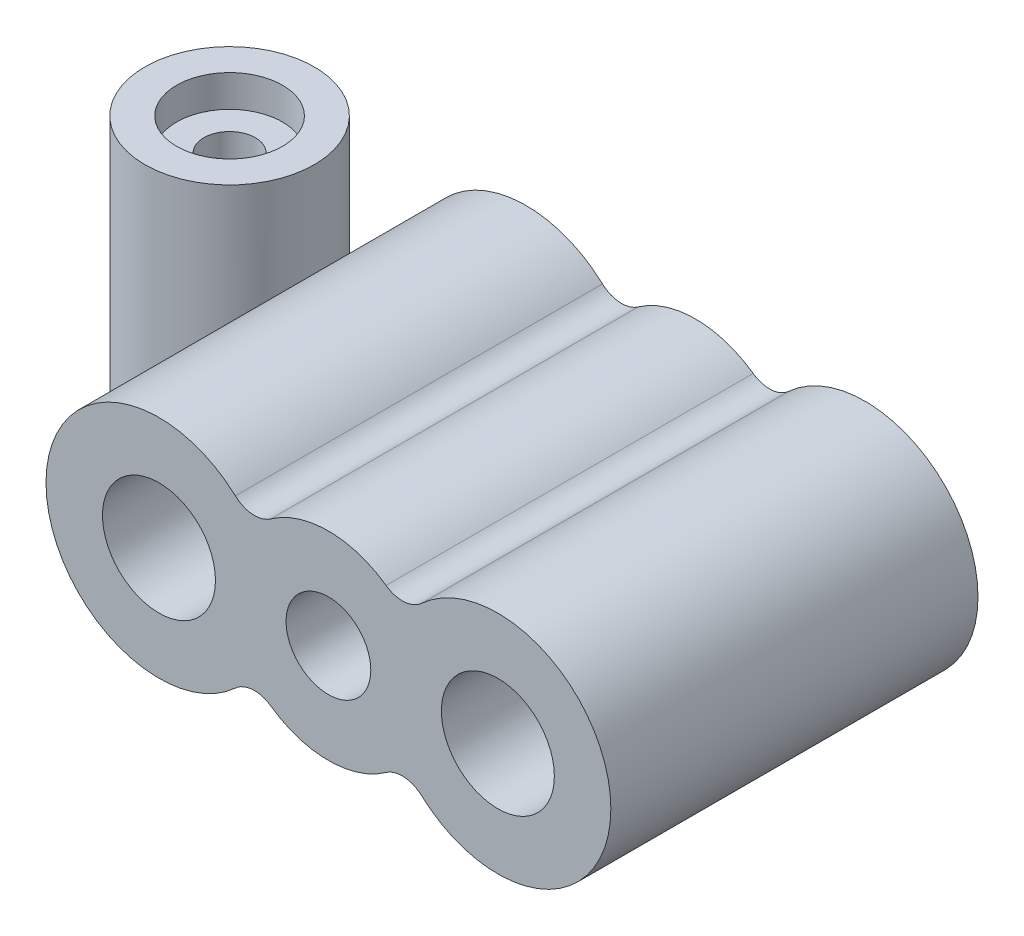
ISO-10303-21;
HEADER;
FILE_DESCRIPTION(('STEP AP214'),'2;1');
FILE_NAME('part.step','',(''),(''),'','','');
FILE_SCHEMA(('AUTOMOTIVE_DESIGN { 1 0 10303 214 1 1 1 1 }'));
ENDSEC;
DATA;
#1=APPLICATION_CONTEXT('core data for automotive mechanical design processes');
#2=APPLICATION_PROTOCOL_DEFINITION('international standard','automotive_design',2000,#1);
#3=PRODUCT_CONTEXT('',#1,'mechanical');
#4=PRODUCT('Part','Part','',(#3));
#5=PRODUCT_RELATED_PRODUCT_CATEGORY('part','',(#4));
#6=PRODUCT_DEFINITION_FORMATION('','',#4);
#7=PRODUCT_DEFINITION_CONTEXT('part definition',#1,'design');
#8=PRODUCT_DEFINITION('design','',#6,#7);
#9=PRODUCT_DEFINITION_SHAPE('','',#8);
#10=(LENGTH_UNIT() NAMED_UNIT(*) SI_UNIT(.MILLI.,.METRE.));
#11=(NAMED_UNIT(*) PLANE_ANGLE_UNIT() SI_UNIT($,.RADIAN.));
#12=(NAMED_UNIT(*) SI_UNIT($,.STERADIAN.) SOLID_ANGLE_UNIT());
#13=UNCERTAINTY_MEASURE_WITH_UNIT(LENGTH_MEASURE(1.E-05),#10,'distance_accuracy_value','');
#14=(GEOMETRIC_REPRESENTATION_CONTEXT(3) GLOBAL_UNCERTAINTY_ASSIGNED_CONTEXT((#13)) GLOBAL_UNIT_ASSIGNED_CONTEXT((#10,
#11,#12)) REPRESENTATION_CONTEXT('',''));
#15=CARTESIAN_POINT('',(0.,0.,0.));
#16=DIRECTION('',(0.,0.,1.));
#17=DIRECTION('',(1.,0.,0.));
#18=AXIS2_PLACEMENT_3D('',#15,#16,#17);
#19=CARTESIAN_POINT('',(-19.05,0.,20.6375));
#20=DIRECTION('',(0.,0.,-1.));
#21=DIRECTION('',(-1.,0.,0.));
#22=AXIS2_PLACEMENT_3D('',#19,#20,#21);
#23=CYLINDRICAL_SURFACE('',#22,12.7);
#24=CARTESIAN_POINT('',(-19.05,0.,-20.6375));
#25=DIRECTION('',(0.,0.,1.));
#26=DIRECTION('',(1.,0.,0.));
#27=AXIS2_PLACEMENT_3D('',#24,#25,#26);
#28=CIRCLE('',#27,12.7);
#29=CARTESIAN_POINT('',(-10.462768,9.356786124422,-20.6375));
#30=VERTEX_POINT('',#29);
#31=CARTESIAN_POINT('',(-10.462768,-9.356786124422,-20.6375));
#32=VERTEX_POINT('',#31);
#33=EDGE_CURVE('E96',#30,#32,#28,.T.);
#34=ORIENTED_EDGE('',*,*,#33,.T.);
#35=DIRECTION('',(0.,0.,-1.));
#36=VECTOR('',#35,1.);
#37=CARTESIAN_POINT('',(-10.462768,-9.356786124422,20.6375));
#38=LINE('',#37,#36);
#39=CARTESIAN_POINT('',(-10.462768,-9.356786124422,20.6375));
#40=VERTEX_POINT('',#39);
#41=EDGE_CURVE('E113',#40,#32,#38,.T.);
#42=ORIENTED_EDGE('',*,*,#41,.F.);
#43=CARTESIAN_POINT('',(-19.05,0.,20.6375));
#44=DIRECTION('',(0.,0.,1.));
#45=DIRECTION('',(1.,0.,0.));
#46=AXIS2_PLACEMENT_3D('',#43,#44,#45);
#47=CIRCLE('',#46,12.7);
#48=CARTESIAN_POINT('',(-10.462768,9.356786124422,20.6375));
#49=VERTEX_POINT('',#48);
#50=EDGE_CURVE('E110',#49,#40,#47,.T.);
#51=ORIENTED_EDGE('',*,*,#50,.F.);
#52=DIRECTION('',(0.,0.,-1.));
#53=VECTOR('',#52,1.);
#54=CARTESIAN_POINT('',(-10.462768,9.356786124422,20.6375));
#55=LINE('',#54,#53);
#56=EDGE_CURVE('E39',#49,#30,#55,.T.);
#57=ORIENTED_EDGE('',*,*,#56,.T.);
#58=EDGE_LOOP('',(#34,#42,#51,#57));
#59=FACE_BOUND('',#58,.T.);
#60=CARTESIAN_POINT('',(-31.75,0.,0.749515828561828));
#61=CARTESIAN_POINT('',(-31.7499985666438,0.250708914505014,0.749516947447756));
#62=CARTESIAN_POINT('',(-31.742564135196,0.501493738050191,0.742886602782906));
#63=CARTESIAN_POINT('',(-31.7129240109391,1.00157675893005,0.716206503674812));
#64=CARTESIAN_POINT('',(-31.6907100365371,1.25087404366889,0.696149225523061));
#65=CARTESIAN_POINT('',(-31.6317674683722,1.74689660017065,0.642081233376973));
#66=CARTESIAN_POINT('',(-31.5950017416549,1.99361362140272,0.608034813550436));
#67=CARTESIAN_POINT('',(-31.5075684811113,2.48204077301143,0.525252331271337));
#68=CARTESIAN_POINT('',(-31.4569031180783,2.72375167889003,0.476518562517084));
#69=CARTESIAN_POINT('',(-31.3423449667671,3.20137659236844,0.363139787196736));
#70=CARTESIAN_POINT('',(-31.2783968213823,3.43726156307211,0.298427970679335));
#71=CARTESIAN_POINT('',(-31.1387191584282,3.90016785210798,0.152032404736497));
#72=CARTESIAN_POINT('',(-31.0629884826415,4.12718829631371,0.0703469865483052));
#73=CARTESIAN_POINT('',(-30.9016998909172,4.56974501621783,-0.111026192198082));
#74=CARTESIAN_POINT('',(-30.8161612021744,4.78530258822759,-0.210678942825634));
#75=CARTESIAN_POINT('',(-30.6374644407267,5.20309915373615,-0.42918244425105));
#76=CARTESIAN_POINT('',(-30.5443087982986,5.40534235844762,-0.548027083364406));
#77=CARTESIAN_POINT('',(-30.3752977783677,5.74938841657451,-0.775969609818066));
#78=CARTESIAN_POINT('',(-30.3004057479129,5.89437539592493,-0.880996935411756));
#79=CARTESIAN_POINT('',(-30.1493398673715,6.17413200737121,-1.10303428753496));
#80=CARTESIAN_POINT('',(-30.0731662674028,6.30890360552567,-1.22004199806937));
#81=CARTESIAN_POINT('',(-29.9212108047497,6.56728576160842,-1.46595353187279));
#82=CARTESIAN_POINT('',(-29.8454288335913,6.69089958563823,-1.59485385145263));
#83=CARTESIAN_POINT('',(-29.6959837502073,6.92621561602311,-1.8642606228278));
#84=CARTESIAN_POINT('',(-29.622320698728,7.03791748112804,-2.00476740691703));
#85=CARTESIAN_POINT('',(-29.4786170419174,7.24916109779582,-2.2973417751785));
#86=CARTESIAN_POINT('',(-29.4085914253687,7.34865453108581,-2.4494516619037));
#87=CARTESIAN_POINT('',(-29.2742105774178,7.53449909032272,-2.76387522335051));
#88=CARTESIAN_POINT('',(-29.2098554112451,7.62085006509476,-2.92618901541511));
#89=CARTESIAN_POINT('',(-29.0884261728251,7.78010513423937,-3.25990449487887));
#90=CARTESIAN_POINT('',(-29.031352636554,7.85300823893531,-3.43130684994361));
#91=CARTESIAN_POINT('',(-28.9259176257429,7.98519929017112,-3.78186239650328));
#92=CARTESIAN_POINT('',(-28.8775556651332,8.04448799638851,-3.96101515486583));
#93=CARTESIAN_POINT('',(-28.7938092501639,8.14568491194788,-4.31265938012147));
#94=CARTESIAN_POINT('',(-28.7577475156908,8.18852777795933,-4.48472170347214));
#95=CARTESIAN_POINT('',(-28.6949115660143,8.26244746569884,-4.83301448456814));
#96=CARTESIAN_POINT('',(-28.6681368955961,8.29352486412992,-5.0092447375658));
#97=CARTESIAN_POINT('',(-28.6244223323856,8.34395301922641,-5.36456020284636));
#98=CARTESIAN_POINT('',(-28.6074814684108,8.36330493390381,-5.54364513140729));
#99=CARTESIAN_POINT('',(-28.5837701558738,8.39032486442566,-5.90336437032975));
#100=CARTESIAN_POINT('',(-28.5769997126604,8.39799287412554,-6.08399868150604));
#101=CARTESIAN_POINT('',(-28.5737944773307,8.4016273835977,-6.44201899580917));
#102=CARTESIAN_POINT('',(-28.5771645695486,8.39781478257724,-6.61940108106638));
#103=CARTESIAN_POINT('',(-28.5937540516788,8.37895674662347,-6.97310207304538));
#104=CARTESIAN_POINT('',(-28.6069732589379,8.36391152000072,-7.14942099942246));
#105=CARTESIAN_POINT('',(-28.6430045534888,8.32256053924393,-7.49972216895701));
#106=CARTESIAN_POINT('',(-28.6658155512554,8.29625606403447,-7.6737046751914));
#107=CARTESIAN_POINT('',(-28.7205857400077,8.23234718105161,-8.01811811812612));
#108=CARTESIAN_POINT('',(-28.7525449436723,8.1947427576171,-8.18854904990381));
#109=CARTESIAN_POINT('',(-28.8249568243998,8.10823012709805,-8.52456191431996));
#110=CARTESIAN_POINT('',(-28.8654046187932,8.05932841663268,-8.6901465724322));
#111=CARTESIAN_POINT('',(-28.9539876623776,7.95021773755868,-9.01542631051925));
#112=CARTESIAN_POINT('',(-29.0021228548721,7.89000885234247,-9.17512143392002));
#113=CARTESIAN_POINT('',(-29.105085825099,7.75836489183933,-9.48754594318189));
#114=CARTESIAN_POINT('',(-29.1599127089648,7.68693131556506,-9.6402762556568));
#115=CARTESIAN_POINT('',(-29.2751268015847,7.53299536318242,-9.93785421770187));
#116=CARTESIAN_POINT('',(-29.3355140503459,7.45049290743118,-10.0827018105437));
#117=CARTESIAN_POINT('',(-29.461299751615,7.2737014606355,-10.3653052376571));
#118=CARTESIAN_POINT('',(-29.5267470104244,7.17929011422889,-10.5029627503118));
#119=CARTESIAN_POINT('',(-29.6606974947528,6.97979475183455,-10.7688197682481));
#120=CARTESIAN_POINT('',(-29.7292019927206,6.87470626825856,-10.8970152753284));
#121=CARTESIAN_POINT('',(-29.8678431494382,6.65441233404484,-11.1434552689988));
#122=CARTESIAN_POINT('',(-29.9379799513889,6.53920599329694,-11.2616988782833));
#123=CARTESIAN_POINT('',(-30.0784754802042,6.29936796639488,-11.4879471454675));
#124=CARTESIAN_POINT('',(-30.1488341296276,6.17473928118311,-11.5959550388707));
#125=CARTESIAN_POINT('',(-30.2926894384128,5.90898537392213,-11.8079216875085));
#126=CARTESIAN_POINT('',(-30.3661202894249,5.76731879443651,-11.9112461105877));
#127=CARTESIAN_POINT('',(-30.5103552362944,5.47510810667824,-12.1065318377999));
#128=CARTESIAN_POINT('',(-30.5811592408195,5.32456369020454,-12.1984927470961));
#129=CARTESIAN_POINT('',(-30.7188983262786,5.01551991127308,-12.3713941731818));
#130=CARTESIAN_POINT('',(-30.7858320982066,4.85701789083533,-12.4523309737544));
#131=CARTESIAN_POINT('',(-30.9147243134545,4.53306927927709,-12.6035840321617));
#132=CARTESIAN_POINT('',(-30.9766821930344,4.36762190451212,-12.6738990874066));
#133=CARTESIAN_POINT('',(-31.1023994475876,4.00878431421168,-12.8129026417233));
#134=CARTESIAN_POINT('',(-31.1653414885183,3.81456227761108,-12.8801851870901));
#135=CARTESIAN_POINT('',(-31.282638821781,3.41979013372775,-13.0025480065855));
#136=CARTESIAN_POINT('',(-31.3369934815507,3.21923956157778,-13.0576273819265));
#137=CARTESIAN_POINT('',(-31.436321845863,2.81296656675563,-13.1563150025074));
#138=CARTESIAN_POINT('',(-31.4812913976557,2.60724189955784,-13.1999181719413));
#139=CARTESIAN_POINT('',(-31.5612137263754,2.1918661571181,-13.2762506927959));
#140=CARTESIAN_POINT('',(-31.5961657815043,1.98221480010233,-13.3089792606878));
#141=CARTESIAN_POINT('',(-31.6599899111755,1.52902556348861,-13.3681246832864));
#142=CARTESIAN_POINT('',(-31.6872115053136,1.28503917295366,-13.3929050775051));
#143=CARTESIAN_POINT('',(-31.7274832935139,0.794919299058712,-13.429363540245));
#144=CARTESIAN_POINT('',(-31.7405322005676,0.54878562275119,-13.4410404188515));
#145=CARTESIAN_POINT('',(-31.7522733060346,0.0557212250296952,-13.4515530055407));
#146=CARTESIAN_POINT('',(-31.7509550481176,-0.191209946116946,-13.4503793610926));
#147=CARTESIAN_POINT('',(-31.7339556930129,-0.684179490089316,-13.43514160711));
#148=CARTESIAN_POINT('',(-31.7182743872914,-0.930217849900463,-13.4210773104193));
#149=CARTESIAN_POINT('',(-31.6710867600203,-1.43801808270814,-13.3782148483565));
#150=CARTESIAN_POINT('',(-31.6384946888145,-1.69959531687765,-13.3484028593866));
#151=CARTESIAN_POINT('',(-31.5575686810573,-2.21800641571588,-13.2728087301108));
#152=CARTESIAN_POINT('',(-31.5092329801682,-2.47483974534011,-13.2270247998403));
#153=CARTESIAN_POINT('',(-31.3978076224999,-2.9814169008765,-13.1184774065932));
#154=CARTESIAN_POINT('',(-31.3347299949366,-3.23116632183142,-13.0557277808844));
#155=CARTESIAN_POINT('',(-31.1951849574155,-3.7214774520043,-12.9119500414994));
#156=CARTESIAN_POINT('',(-31.118720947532,-3.96204147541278,-12.8309265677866));
#157=CARTESIAN_POINT('',(-30.970891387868,-4.38427400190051,-12.6675140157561));
#158=CARTESIAN_POINT('',(-30.9015967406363,-4.56805192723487,-12.5886814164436));
#159=CARTESIAN_POINT('',(-30.7569782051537,-4.92687021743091,-12.4177988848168));
#160=CARTESIAN_POINT('',(-30.6816554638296,-5.10191223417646,-12.3257514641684));
#161=CARTESIAN_POINT('',(-30.5265519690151,-5.44184180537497,-12.1279141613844));
#162=CARTESIAN_POINT('',(-30.4467736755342,-5.60673485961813,-12.0221318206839));
#163=CARTESIAN_POINT('',(-30.2845273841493,-5.92514323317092,-11.7964046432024));
#164=CARTESIAN_POINT('',(-30.2020593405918,-6.07865835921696,-11.6764595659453));
#165=CARTESIAN_POINT('',(-30.0359419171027,-6.37400808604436,-11.4214775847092));
#166=CARTESIAN_POINT('',(-29.9522883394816,-6.51575985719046,-11.2863472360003));
#167=CARTESIAN_POINT('',(-29.786599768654,-6.78531233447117,-11.0018901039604));
#168=CARTESIAN_POINT('',(-29.7045648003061,-6.91311282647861,-10.852563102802));
#169=CARTESIAN_POINT('',(-29.5444867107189,-7.15378520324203,-10.5404136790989));
#170=CARTESIAN_POINT('',(-29.4664424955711,-7.26666119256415,-10.377594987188));
#171=CARTESIAN_POINT('',(-29.3166363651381,-7.47682037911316,-10.0394872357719));
#172=CARTESIAN_POINT('',(-29.24487370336,-7.57410543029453,-9.86419966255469));
#173=CARTESIAN_POINT('',(-29.1175489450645,-7.74236911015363,-9.52338758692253));
#174=CARTESIAN_POINT('',(-29.0610728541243,-7.81508650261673,-9.35905944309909));
#175=CARTESIAN_POINT('',(-28.9560327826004,-7.94780990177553,-9.02291667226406));
#176=CARTESIAN_POINT('',(-28.9074681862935,-8.00781689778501,-8.8511026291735));
#177=CARTESIAN_POINT('',(-28.8193738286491,-8.11505730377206,-8.50130900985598));
#178=CARTESIAN_POINT('',(-28.7798429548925,-8.16229228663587,-8.32333019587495));
#179=CARTESIAN_POINT('',(-28.7107012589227,-8.24401123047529,-7.96258170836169));
#180=CARTESIAN_POINT('',(-28.6810902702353,-8.27849540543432,-7.77981211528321));
#181=CARTESIAN_POINT('',(-28.633717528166,-8.3332825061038,-7.42060976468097));
#182=CARTESIAN_POINT('',(-28.615416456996,-8.35423350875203,-7.24434639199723));
#183=CARTESIAN_POINT('',(-28.5886662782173,-8.38476355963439,-6.89009679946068));
#184=CARTESIAN_POINT('',(-28.580216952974,-8.39434285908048,-6.71211061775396));
#185=CARTESIAN_POINT('',(-28.5733344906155,-8.40215015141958,-6.3557173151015));
#186=CARTESIAN_POINT('',(-28.5749002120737,-8.40037943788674,-6.17731024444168));
#187=CARTESIAN_POINT('',(-28.5880148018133,-8.38548578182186,-5.82133732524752));
#188=CARTESIAN_POINT('',(-28.5995637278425,-8.37236277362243,-5.64377148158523));
#189=CARTESIAN_POINT('',(-28.6323165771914,-8.33485590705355,-5.29187694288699));
#190=CARTESIAN_POINT('',(-28.6534590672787,-8.31054368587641,-5.11753488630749));
#191=CARTESIAN_POINT('',(-28.7049692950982,-8.25064398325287,-4.77218430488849));
#192=CARTESIAN_POINT('',(-28.7353369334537,-8.21505662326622,-4.60117574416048));
#193=CARTESIAN_POINT('',(-28.8046932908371,-8.13258005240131,-4.26371956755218));
#194=CARTESIAN_POINT('',(-28.8436808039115,-8.08569242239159,-4.09727131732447));
#195=CARTESIAN_POINT('',(-28.9294952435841,-7.98061219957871,-3.77006285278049));
#196=CARTESIAN_POINT('',(-28.9763221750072,-7.92241959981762,-3.60930264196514));
#197=CARTESIAN_POINT('',(-29.0769784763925,-7.79463461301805,-3.29416365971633));
#198=CARTESIAN_POINT('',(-29.1308244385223,-7.72501510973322,-3.13980118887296));
#199=CARTESIAN_POINT('',(-29.2443098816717,-7.57462306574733,-2.83884005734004));
#200=CARTESIAN_POINT('',(-29.3039493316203,-7.49385058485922,-2.69224135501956));
#201=CARTESIAN_POINT('',(-29.4277647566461,-7.32142443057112,-2.40766079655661));
#202=CARTESIAN_POINT('',(-29.4919398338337,-7.22977290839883,-2.26967724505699));
#203=CARTESIAN_POINT('',(-29.6235321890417,-7.03591794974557,-2.00290299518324));
#204=CARTESIAN_POINT('',(-29.6909506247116,-6.93371073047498,-1.87411562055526));
#205=CARTESIAN_POINT('',(-29.8295519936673,-6.71627387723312,-1.62279343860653));
#206=CARTESIAN_POINT('',(-29.900787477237,-6.60076051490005,-1.50053325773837));
#207=CARTESIAN_POINT('',(-30.0437582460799,-6.35978816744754,-1.26655648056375));
#208=CARTESIAN_POINT('',(-30.1154935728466,-6.23432834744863,-1.15484077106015));
#209=CARTESIAN_POINT('',(-30.258074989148,-5.97419914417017,-0.942019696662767));
#210=CARTESIAN_POINT('',(-30.3289208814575,-5.83952775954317,-0.840916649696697));
#211=CARTESIAN_POINT('',(-30.4684022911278,-5.56185464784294,-0.649264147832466));
#212=CARTESIAN_POINT('',(-30.5370382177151,-5.4188544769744,-0.558712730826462));
#213=CARTESIAN_POINT('',(-30.6771997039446,-5.11168344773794,-0.379929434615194));
#214=CARTESIAN_POINT('',(-30.7483992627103,-4.94678113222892,-0.292698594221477));
#215=CARTESIAN_POINT('',(-30.885496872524,-4.60914544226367,-0.130041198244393));
#216=CARTESIAN_POINT('',(-30.9513945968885,-4.43641158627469,-0.0546153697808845));
#217=CARTESIAN_POINT('',(-31.0768642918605,-4.0840594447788,0.0850613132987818));
#218=CARTESIAN_POINT('',(-31.1364302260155,-3.90443480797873,0.149301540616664));
#219=CARTESIAN_POINT('',(-31.2482904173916,-3.53951194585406,0.267121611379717));
#220=CARTESIAN_POINT('',(-31.3005839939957,-3.35421319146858,0.320700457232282));
#221=CARTESIAN_POINT('',(-31.4044537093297,-2.95078174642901,0.425064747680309));
#222=CARTESIAN_POINT('',(-31.4547439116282,-2.73189556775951,0.474223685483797));
#223=CARTESIAN_POINT('',(-31.5439882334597,-2.28937295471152,0.56000461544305));
#224=CARTESIAN_POINT('',(-31.5829398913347,-2.06573550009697,0.59662388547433));
#225=CARTESIAN_POINT('',(-31.6488858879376,-1.61547803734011,0.657907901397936));
#226=CARTESIAN_POINT('',(-31.6758995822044,-1.38886347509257,0.682592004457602));
#227=CARTESIAN_POINT('',(-31.717695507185,-0.933645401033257,0.720545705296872));
#228=CARTESIAN_POINT('',(-31.7324835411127,-0.705042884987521,0.733820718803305));
#229=CARTESIAN_POINT('',(-31.7440482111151,-0.396791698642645,0.744188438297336));
#230=CARTESIAN_POINT('',(-31.7462795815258,-0.317463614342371,0.746186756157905));
#231=CARTESIAN_POINT('',(-31.7492556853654,-0.158759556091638,0.748850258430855));
#232=CARTESIAN_POINT('',(-31.7500004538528,-0.0793835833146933,0.749515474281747));
#233=CARTESIAN_POINT('',(-31.75,0.,0.749515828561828));
#234=B_SPLINE_CURVE_WITH_KNOTS('',3,(#60,#61,#62,#63,#64,#65,#66,#67,#68,#69,#70,#71,#72,#73,
#74,#75,#76,#77,#78,#79,#80,#81,#82,#83,#84,#85,#86,#87,#88,#89,#90,#91,#92,#93,#94,#95,#96,#97,
#98,#99,#100,#101,#102,#103,#104,#105,#106,#107,#108,#109,#110,#111,#112,#113,#114,#115,#116,
#117,#118,#119,#120,#121,#122,#123,#124,#125,#126,#127,#128,#129,#130,#131,#132,#133,#134,#135,
#136,#137,#138,#139,#140,#141,#142,#143,#144,#145,#146,#147,#148,#149,#150,#151,#152,#153,#154,
#155,#156,#157,#158,#159,#160,#161,#162,#163,#164,#165,#166,#167,#168,#169,#170,#171,#172,#173,
#174,#175,#176,#177,#178,#179,#180,#181,#182,#183,#184,#185,#186,#187,#188,#189,#190,#191,#192,
#193,#194,#195,#196,#197,#198,#199,#200,#201,#202,#203,#204,#205,#206,#207,#208,#209,#210,#211,
#212,#213,#214,#215,#216,#217,#218,#219,#220,#221,#222,#223,#224,#225,#226,#227,#228,#229,#230,
#231,#232,#233),.UNSPECIFIED.,.T.,.F.,(4,2,2,2,2,2,2,2,2,2,2,2,2,2,2,2,2,2,2,2,2,2,2,2,2,2,2,2,
2,2,2,2,2,2,2,2,2,2,2,2,2,2,2,2,2,2,2,2,2,2,2,2,2,2,2,2,2,2,2,2,2,2,2,2,2,2,2,2,2,2,2,2,2,2,2,2,
2,2,2,2,2,2,2,2,2,2,4),(0.,0.752059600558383,1.50454096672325,2.25895501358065,3.01325130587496,
3.77075664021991,4.52833648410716,5.28445580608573,6.04033481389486,6.62193433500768,
7.20342163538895,7.78473816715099,8.36607134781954,8.94963579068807,9.53320694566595,
10.1168210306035,10.7004025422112,11.2425812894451,11.7847334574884,12.3268320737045,
12.8689309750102,13.4006663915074,13.9323919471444,14.4640571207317,14.9957230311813,
15.5270839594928,16.058440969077,16.5897270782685,17.1210170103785,17.6582945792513,
18.1957978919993,18.7333485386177,19.2707286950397,19.8404323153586,20.4101557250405,
20.9800707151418,21.5500501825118,22.1943036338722,22.8386045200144,23.4831898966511,
24.1278217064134,24.8672713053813,25.6067880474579,26.3468430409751,27.0869087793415,
27.8817705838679,28.6767214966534,29.4710259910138,30.2651290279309,30.8994171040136,
31.5335847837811,32.1674057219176,32.8012374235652,33.4392084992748,34.0771893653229,
34.714994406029,35.3527235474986,35.9170943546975,36.4814212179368,37.0456785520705,
37.6099264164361,38.1446255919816,38.6793129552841,39.2139393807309,39.748568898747,
40.2798221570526,40.8110696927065,41.3422429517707,41.8734165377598,42.4058693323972,
42.9383192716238,43.4706640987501,44.0032003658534,44.5505916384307,45.0980289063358,
45.6455854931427,46.1930400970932,46.7914691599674,47.3899350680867,47.9889665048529,
48.5880539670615,49.2770671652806,49.9662298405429,50.6542710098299,51.3419853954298,
51.5801205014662,51.8182499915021),.UNSPECIFIED.);
#235=CARTESIAN_POINT('',(-31.75,0.,0.749515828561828));
#236=VERTEX_POINT('',#235);
#237=EDGE_CURVE('E11',#236,#236,#234,.T.);
#238=ORIENTED_EDGE('',*,*,#237,.F.);
#239=EDGE_LOOP('',(#238));
#240=FACE_BOUND('',#239,.T.);
#241=ADVANCED_FACE('F28',(#59,#240),#23,.T.);
#242=CARTESIAN_POINT('',(-8.31596,11.6959826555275,20.6375));
#243=DIRECTION('',(0.,0.,-1.));
#244=DIRECTION('',(-1.,0.,0.));
#245=AXIS2_PLACEMENT_3D('',#242,#243,#244);
#246=CYLINDRICAL_SURFACE('',#245,3.175);
#247=CARTESIAN_POINT('',(-8.31596,11.6959826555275,-20.6375));
#248=DIRECTION('',(0.,0.,-1.));
#249=DIRECTION('',(1.,0.,0.));
#250=AXIS2_PLACEMENT_3D('',#247,#248,#249);
#251=CIRCLE('',#250,3.175);
#252=CARTESIAN_POINT('',(-6.47614584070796,9.10837587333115,-20.6375));
#253=VERTEX_POINT('',#252);
#254=EDGE_CURVE('E101',#253,#30,#251,.T.);
#255=ORIENTED_EDGE('',*,*,#254,.T.);
#256=ORIENTED_EDGE('',*,*,#56,.F.);
#257=CARTESIAN_POINT('',(-8.31596,11.6959826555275,20.6375));
#258=DIRECTION('',(0.,0.,-1.));
#259=DIRECTION('',(1.,0.,0.));
#260=AXIS2_PLACEMENT_3D('',#257,#258,#259);
#261=CIRCLE('',#260,3.175);
#262=CARTESIAN_POINT('',(-6.47614584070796,9.10837587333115,20.6375));
#263=VERTEX_POINT('',#262);
#264=EDGE_CURVE('E134',#263,#49,#261,.T.);
#265=ORIENTED_EDGE('',*,*,#264,.F.);
#266=DIRECTION('',(0.,0.,-1.));
#267=VECTOR('',#266,1.);
#268=CARTESIAN_POINT('',(-6.47614584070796,9.10837587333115,20.6375));
#269=LINE('',#268,#267);
#270=EDGE_CURVE('E115',#263,#253,#269,.T.);
#271=ORIENTED_EDGE('',*,*,#270,.T.);
#272=EDGE_LOOP('',(#255,#256,#265,#271));
#273=FACE_BOUND('',#272,.T.);
#274=ADVANCED_FACE('F30',(#273),#246,.F.);
#275=CARTESIAN_POINT('',(-8.31596,-11.6959826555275,20.6375));
#276=DIRECTION('',(0.,0.,-1.));
#277=DIRECTION('',(-1.,0.,0.));
#278=AXIS2_PLACEMENT_3D('',#275,#276,#277);
#279=CYLINDRICAL_SURFACE('',#278,3.175);
#280=CARTESIAN_POINT('',(-8.31596,-11.6959826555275,-20.6375));
#281=DIRECTION('',(0.,0.,-1.));
#282=DIRECTION('',(-1.,0.,0.));
#283=AXIS2_PLACEMENT_3D('',#280,#281,#282);
#284=CIRCLE('',#283,3.175);
#285=CARTESIAN_POINT('',(-6.47614584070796,-9.10837587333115,-20.6375));
#286=VERTEX_POINT('',#285);
#287=EDGE_CURVE('E103',#32,#286,#284,.T.);
#288=ORIENTED_EDGE('',*,*,#287,.T.);
#289=DIRECTION('',(0.,0.,-1.));
#290=VECTOR('',#289,1.);
#291=CARTESIAN_POINT('',(-6.47614584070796,-9.10837587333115,20.6375));
#292=LINE('',#291,#290);
#293=CARTESIAN_POINT('',(-6.47614584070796,-9.10837587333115,20.6375));
#294=VERTEX_POINT('',#293);
#295=EDGE_CURVE('E160',#294,#286,#292,.T.);
#296=ORIENTED_EDGE('',*,*,#295,.F.);
#297=CARTESIAN_POINT('',(-8.31596,-11.6959826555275,20.6375));
#298=DIRECTION('',(0.,0.,-1.));
#299=DIRECTION('',(-1.,0.,0.));
#300=AXIS2_PLACEMENT_3D('',#297,#298,#299);
#301=CIRCLE('',#300,3.175);
#302=EDGE_CURVE('E137',#40,#294,#301,.T.);
#303=ORIENTED_EDGE('',*,*,#302,.F.);
#304=ORIENTED_EDGE('',*,*,#41,.T.);
#305=EDGE_LOOP('',(#288,#296,#303,#304));
#306=FACE_BOUND('',#305,.T.);
#307=ADVANCED_FACE('F165',(#306),#279,.F.);
#308=CARTESIAN_POINT('',(0.,0.,20.6375));
#309=DIRECTION('',(0.,0.,-1.));
#310=DIRECTION('',(-1.,0.,0.));
#311=AXIS2_PLACEMENT_3D('',#308,#309,#310);
#312=CYLINDRICAL_SURFACE('',#311,11.176);
#313=CARTESIAN_POINT('',(0.,0.,-20.6375));
#314=DIRECTION('',(0.,0.,1.));
#315=DIRECTION('',(1.,0.,0.));
#316=AXIS2_PLACEMENT_3D('',#313,#314,#315);
#317=CIRCLE('',#316,11.176);
#318=CARTESIAN_POINT('',(6.47614584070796,-9.10837587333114,-20.6375));
#319=VERTEX_POINT('',#318);
#320=EDGE_CURVE('E124',#286,#319,#317,.T.);
#321=ORIENTED_EDGE('',*,*,#320,.T.);
#322=DIRECTION('',(0.,0.,-1.));
#323=VECTOR('',#322,1.);
#324=CARTESIAN_POINT('',(6.47614584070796,-9.10837587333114,20.6375));
#325=LINE('',#324,#323);
#326=CARTESIAN_POINT('',(6.47614584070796,-9.10837587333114,20.6375));
#327=VERTEX_POINT('',#326);
#328=EDGE_CURVE('E157',#327,#319,#325,.T.);
#329=ORIENTED_EDGE('',*,*,#328,.F.);
#330=CARTESIAN_POINT('',(0.,0.,20.6375));
#331=DIRECTION('',(0.,0.,1.));
#332=DIRECTION('',(1.,0.,0.));
#333=AXIS2_PLACEMENT_3D('',#330,#331,#332);
#334=CIRCLE('',#333,11.176);
#335=EDGE_CURVE('E139',#294,#327,#334,.T.);
#336=ORIENTED_EDGE('',*,*,#335,.F.);
#337=ORIENTED_EDGE('',*,*,#295,.T.);
#338=EDGE_LOOP('',(#321,#329,#336,#337));
#339=FACE_BOUND('',#338,.T.);
#340=ADVANCED_FACE('F173',(#339),#312,.T.);
#341=CARTESIAN_POINT('',(8.31596,-11.6959826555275,20.6375));
#342=DIRECTION('',(0.,0.,-1.));
#343=DIRECTION('',(-1.,0.,0.));
#344=AXIS2_PLACEMENT_3D('',#341,#342,#343);
#345=CYLINDRICAL_SURFACE('',#344,3.175);
#346=CARTESIAN_POINT('',(8.31596,-11.6959826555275,-20.6375));
#347=DIRECTION('',(0.,0.,-1.));
#348=DIRECTION('',(1.,0.,0.));
#349=AXIS2_PLACEMENT_3D('',#346,#347,#348);
#350=CIRCLE('',#349,3.175);
#351=CARTESIAN_POINT('',(10.462768,-9.35678612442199,-20.6375));
#352=VERTEX_POINT('',#351);
#353=EDGE_CURVE('E126',#319,#352,#350,.T.);
#354=ORIENTED_EDGE('',*,*,#353,.T.);
#355=DIRECTION('',(0.,0.,-1.));
#356=VECTOR('',#355,1.);
#357=CARTESIAN_POINT('',(10.462768,-9.35678612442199,20.6375));
#358=LINE('',#357,#356);
#359=CARTESIAN_POINT('',(10.462768,-9.35678612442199,20.6375));
#360=VERTEX_POINT('',#359);
#361=EDGE_CURVE('E154',#360,#352,#358,.T.);
#362=ORIENTED_EDGE('',*,*,#361,.F.);
#363=CARTESIAN_POINT('',(8.31596,-11.6959826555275,20.6375));
#364=DIRECTION('',(0.,0.,-1.));
#365=DIRECTION('',(1.,0.,0.));
#366=AXIS2_PLACEMENT_3D('',#363,#364,#365);
#367=CIRCLE('',#366,3.175);
#368=EDGE_CURVE('E141',#327,#360,#367,.T.);
#369=ORIENTED_EDGE('',*,*,#368,.F.);
#370=ORIENTED_EDGE('',*,*,#328,.T.);
#371=EDGE_LOOP('',(#354,#362,#369,#370));
#372=FACE_BOUND('',#371,.T.);
#373=ADVANCED_FACE('F176',(#372),#345,.F.);
#374=CARTESIAN_POINT('',(19.05,0.,20.6375));
#375=DIRECTION('',(0.,0.,-1.));
#376=DIRECTION('',(-1.,0.,0.));
#377=AXIS2_PLACEMENT_3D('',#374,#375,#376);
#378=CYLINDRICAL_SURFACE('',#377,12.7);
#379=CARTESIAN_POINT('',(19.05,0.,-20.6375));
#380=DIRECTION('',(0.,0.,1.));
#381=DIRECTION('',(1.,0.,0.));
#382=AXIS2_PLACEMENT_3D('',#379,#380,#381);
#383=CIRCLE('',#382,12.7);
#384=CARTESIAN_POINT('',(10.462768,9.35678612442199,-20.6375));
#385=VERTEX_POINT('',#384);
#386=EDGE_CURVE('E128',#352,#385,#383,.T.);
#387=ORIENTED_EDGE('',*,*,#386,.T.);
#388=DIRECTION('',(0.,0.,-1.));
#389=VECTOR('',#388,1.);
#390=CARTESIAN_POINT('',(10.462768,9.35678612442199,20.6375));
#391=LINE('',#390,#389);
#392=CARTESIAN_POINT('',(10.462768,9.35678612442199,20.6375));
#393=VERTEX_POINT('',#392);
#394=EDGE_CURVE('E151',#393,#385,#391,.T.);
#395=ORIENTED_EDGE('',*,*,#394,.F.);
#396=CARTESIAN_POINT('',(19.05,0.,20.6375));
#397=DIRECTION('',(0.,0.,1.));
#398=DIRECTION('',(1.,0.,0.));
#399=AXIS2_PLACEMENT_3D('',#396,#397,#398);
#400=CIRCLE('',#399,12.7);
#401=EDGE_CURVE('E143',#360,#393,#400,.T.);
#402=ORIENTED_EDGE('',*,*,#401,.F.);
#403=ORIENTED_EDGE('',*,*,#361,.T.);
#404=EDGE_LOOP('',(#387,#395,#402,#403));
#405=FACE_BOUND('',#404,.T.);
#406=ADVANCED_FACE('F181',(#405),#378,.T.);
#407=CARTESIAN_POINT('',(8.31596,11.6959826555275,20.6375));
#408=DIRECTION('',(0.,0.,-1.));
#409=DIRECTION('',(-1.,0.,0.));
#410=AXIS2_PLACEMENT_3D('',#407,#408,#409);
#411=CYLINDRICAL_SURFACE('',#410,3.175);
#412=CARTESIAN_POINT('',(8.31596,11.6959826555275,-20.6375));
#413=DIRECTION('',(0.,0.,-1.));
#414=DIRECTION('',(-1.,0.,0.));
#415=AXIS2_PLACEMENT_3D('',#412,#413,#414);
#416=CIRCLE('',#415,3.175);
#417=CARTESIAN_POINT('',(6.47614584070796,9.10837587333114,-20.6375));
#418=VERTEX_POINT('',#417);
#419=EDGE_CURVE('E130',#385,#418,#416,.T.);
#420=ORIENTED_EDGE('',*,*,#419,.T.);
#421=DIRECTION('',(0.,0.,-1.));
#422=VECTOR('',#421,1.);
#423=CARTESIAN_POINT('',(6.47614584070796,9.10837587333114,20.6375));
#424=LINE('',#423,#422);
#425=CARTESIAN_POINT('',(6.47614584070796,9.10837587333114,20.6375));
#426=VERTEX_POINT('',#425);
#427=EDGE_CURVE('E148',#426,#418,#424,.T.);
#428=ORIENTED_EDGE('',*,*,#427,.F.);
#429=CARTESIAN_POINT('',(8.31596,11.6959826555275,20.6375));
#430=DIRECTION('',(0.,0.,-1.));
#431=DIRECTION('',(-1.,0.,0.));
#432=AXIS2_PLACEMENT_3D('',#429,#430,#431);
#433=CIRCLE('',#432,3.175);
#434=EDGE_CURVE('E51',#393,#426,#433,.T.);
#435=ORIENTED_EDGE('',*,*,#434,.F.);
#436=ORIENTED_EDGE('',*,*,#394,.T.);
#437=EDGE_LOOP('',(#420,#428,#435,#436));
#438=FACE_BOUND('',#437,.T.);
#439=ADVANCED_FACE('F184',(#438),#411,.F.);
#440=CARTESIAN_POINT('',(0.,0.,20.6375));
#441=DIRECTION('',(0.,0.,-1.));
#442=DIRECTION('',(-1.,0.,0.));
#443=AXIS2_PLACEMENT_3D('',#440,#441,#442);
#444=CYLINDRICAL_SURFACE('',#443,11.176);
#445=CARTESIAN_POINT('',(0.,0.,-20.6375));
#446=DIRECTION('',(0.,0.,1.));
#447=DIRECTION('',(1.,0.,0.));
#448=AXIS2_PLACEMENT_3D('',#445,#446,#447);
#449=CIRCLE('',#448,11.176);
#450=EDGE_CURVE('E132',#418,#253,#449,.T.);
#451=ORIENTED_EDGE('',*,*,#450,.T.);
#452=ORIENTED_EDGE('',*,*,#270,.F.);
#453=CARTESIAN_POINT('',(0.,0.,20.6375));
#454=DIRECTION('',(0.,0.,1.));
#455=DIRECTION('',(1.,0.,0.));
#456=AXIS2_PLACEMENT_3D('',#453,#454,#455);
#457=CIRCLE('',#456,11.176);
#458=EDGE_CURVE('E46',#426,#263,#457,.T.);
#459=ORIENTED_EDGE('',*,*,#458,.F.);
#460=ORIENTED_EDGE('',*,*,#427,.T.);
#461=EDGE_LOOP('',(#451,#452,#459,#460));
#462=FACE_BOUND('',#461,.T.);
#463=ADVANCED_FACE('F186',(#462),#444,.T.);
#464=CARTESIAN_POINT('',(-4.15798,5.84799132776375,20.6375));
#465=DIRECTION('',(0.,0.,1.));
#466=DIRECTION('',(1.,0.,0.));
#467=AXIS2_PLACEMENT_3D('',#464,#465,#466);
#468=PLANE('',#467);
#469=CARTESIAN_POINT('',(19.05,0.,20.637499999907));
#470=DIRECTION('',(0.,0.,1.));
#471=DIRECTION('',(1.,0.,0.));
#472=AXIS2_PLACEMENT_3D('',#469,#470,#471);
#473=CIRCLE('',#472,6.35);
#474=CARTESIAN_POINT('',(25.4,0.,20.637499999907));
#475=VERTEX_POINT('',#474);
#476=EDGE_CURVE('E322',#475,#475,#473,.T.);
#477=ORIENTED_EDGE('',*,*,#476,.F.);
#478=EDGE_LOOP('',(#477));
#479=FACE_BOUND('',#478,.T.);
#480=CARTESIAN_POINT('',(0.,0.,20.637499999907));
#481=DIRECTION('',(0.,0.,1.));
#482=DIRECTION('',(1.,0.,0.));
#483=AXIS2_PLACEMENT_3D('',#480,#481,#482);
#484=CIRCLE('',#483,4.7625);
#485=CARTESIAN_POINT('',(4.7625,0.,20.637499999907));
#486=VERTEX_POINT('',#485);
#487=EDGE_CURVE('E328',#486,#486,#484,.T.);
#488=ORIENTED_EDGE('',*,*,#487,.F.);
#489=EDGE_LOOP('',(#488));
#490=FACE_BOUND('',#489,.T.);
#491=CARTESIAN_POINT('',(-19.05,0.,20.6375));
#492=DIRECTION('',(0.,0.,1.));
#493=DIRECTION('',(1.,0.,0.));
#494=AXIS2_PLACEMENT_3D('',#491,#492,#493);
#495=CIRCLE('',#494,6.35);
#496=CARTESIAN_POINT('',(-12.7,0.,20.6375));
#497=VERTEX_POINT('',#496);
#498=EDGE_CURVE('E334',#497,#497,#495,.T.);
#499=ORIENTED_EDGE('',*,*,#498,.F.);
#500=EDGE_LOOP('',(#499));
#501=FACE_BOUND('',#500,.T.);
#502=ORIENTED_EDGE('',*,*,#264,.T.);
#503=ORIENTED_EDGE('',*,*,#50,.T.);
#504=ORIENTED_EDGE('',*,*,#302,.T.);
#505=ORIENTED_EDGE('',*,*,#335,.T.);
#506=ORIENTED_EDGE('',*,*,#368,.T.);
#507=ORIENTED_EDGE('',*,*,#401,.T.);
#508=ORIENTED_EDGE('',*,*,#434,.T.);
#509=ORIENTED_EDGE('',*,*,#458,.T.);
#510=EDGE_LOOP('',(#502,#503,#504,#505,#506,#507,#508,#509));
#511=FACE_BOUND('',#510,.T.);
#512=ADVANCED_FACE('F168',(#479,#490,#501,#511),#468,.T.);
#513=CARTESIAN_POINT('',(-4.15798,5.84799132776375,-20.6375));
#514=DIRECTION('',(0.,0.,1.));
#515=DIRECTION('',(1.,0.,0.));
#516=AXIS2_PLACEMENT_3D('',#513,#514,#515);
#517=PLANE('',#516);
#518=CARTESIAN_POINT('',(19.05,0.,-20.6375));
#519=DIRECTION('',(0.,0.,1.));
#520=DIRECTION('',(1.,0.,0.));
#521=AXIS2_PLACEMENT_3D('',#518,#519,#520);
#522=CIRCLE('',#521,6.35);
#523=CARTESIAN_POINT('',(25.4,0.,-20.6375));
#524=VERTEX_POINT('',#523);
#525=EDGE_CURVE('E325',#524,#524,#522,.T.);
#526=ORIENTED_EDGE('',*,*,#525,.T.);
#527=EDGE_LOOP('',(#526));
#528=FACE_BOUND('',#527,.T.);
#529=CARTESIAN_POINT('',(0.,0.,-20.6375));
#530=DIRECTION('',(0.,0.,1.));
#531=DIRECTION('',(1.,0.,0.));
#532=AXIS2_PLACEMENT_3D('',#529,#530,#531);
#533=CIRCLE('',#532,4.7625);
#534=CARTESIAN_POINT('',(4.7625,0.,-20.6375));
#535=VERTEX_POINT('',#534);
#536=EDGE_CURVE('E331',#535,#535,#533,.T.);
#537=ORIENTED_EDGE('',*,*,#536,.T.);
#538=EDGE_LOOP('',(#537));
#539=FACE_BOUND('',#538,.T.);
#540=CARTESIAN_POINT('',(-19.05,0.,-20.6375));
#541=DIRECTION('',(0.,0.,1.));
#542=DIRECTION('',(1.,0.,0.));
#543=AXIS2_PLACEMENT_3D('',#540,#541,#542);
#544=CIRCLE('',#543,6.35);
#545=CARTESIAN_POINT('',(-12.7,0.,-20.6375));
#546=VERTEX_POINT('',#545);
#547=EDGE_CURVE('E337',#546,#546,#544,.T.);
#548=ORIENTED_EDGE('',*,*,#547,.T.);
#549=EDGE_LOOP('',(#548));
#550=FACE_BOUND('',#549,.T.);
#551=ORIENTED_EDGE('',*,*,#254,.F.);
#552=ORIENTED_EDGE('',*,*,#450,.F.);
#553=ORIENTED_EDGE('',*,*,#419,.F.);
#554=ORIENTED_EDGE('',*,*,#386,.F.);
#555=ORIENTED_EDGE('',*,*,#353,.F.);
#556=ORIENTED_EDGE('',*,*,#320,.F.);
#557=ORIENTED_EDGE('',*,*,#287,.F.);
#558=ORIENTED_EDGE('',*,*,#33,.F.);
#559=EDGE_LOOP('',(#551,#552,#553,#554,#555,#556,#557,#558));
#560=FACE_BOUND('',#559,.T.);
#561=ADVANCED_FACE('F98',(#528,#539,#550,#560),#517,.F.);
#562=CARTESIAN_POINT('',(-38.1,19.05,-6.35));
#563=DIRECTION('',(0.,-1.,0.));
#564=DIRECTION('',(0.,0.,-1.));
#565=AXIS2_PLACEMENT_3D('',#562,#563,#564);
#566=CYLINDRICAL_SURFACE('',#565,9.525);
#567=CARTESIAN_POINT('',(-38.1,-19.05,-6.35));
#568=DIRECTION('',(0.,1.,0.));
#569=DIRECTION('',(0.,0.,1.));
#570=AXIS2_PLACEMENT_3D('',#567,#568,#569);
#571=CIRCLE('',#570,9.525);
#572=CARTESIAN_POINT('',(-38.1,-19.05,3.175));
#573=VERTEX_POINT('',#572);
#574=EDGE_CURVE('E119',#573,#573,#571,.T.);
#575=ORIENTED_EDGE('',*,*,#574,.T.);
#576=EDGE_LOOP('',(#575));
#577=FACE_BOUND('',#576,.T.);
#578=CARTESIAN_POINT('',(-38.1,19.05,-6.35));
#579=DIRECTION('',(0.,1.,0.));
#580=DIRECTION('',(0.,0.,1.));
#581=AXIS2_PLACEMENT_3D('',#578,#579,#580);
#582=CIRCLE('',#581,9.525);
#583=CARTESIAN_POINT('',(-38.1,19.05,3.175));
#584=VERTEX_POINT('',#583);
#585=EDGE_CURVE('E116',#584,#584,#582,.T.);
#586=ORIENTED_EDGE('',*,*,#585,.F.);
#587=EDGE_LOOP('',(#586));
#588=FACE_BOUND('',#587,.T.);
#589=ORIENTED_EDGE('',*,*,#237,.T.);
#590=EDGE_LOOP('',(#589));
#591=FACE_BOUND('',#590,.T.);
#592=ADVANCED_FACE('F231',(#577,#588,#591),#566,.T.);
#593=CARTESIAN_POINT('',(-38.1,19.05,-6.35));
#594=DIRECTION('',(0.,1.,0.));
#595=DIRECTION('',(0.,0.,1.));
#596=AXIS2_PLACEMENT_3D('',#593,#594,#595);
#597=PLANE('',#596);
#598=CARTESIAN_POINT('',(-38.1,19.05,-6.35));
#599=DIRECTION('',(0.,1.,0.));
#600=DIRECTION('',(0.,0.,1.));
#601=AXIS2_PLACEMENT_3D('',#598,#599,#600);
#602=CIRCLE('',#601,5.95376);
#603=CARTESIAN_POINT('',(-38.1,19.05,-0.396240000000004));
#604=VERTEX_POINT('',#603);
#605=EDGE_CURVE('E316',#604,#604,#602,.T.);
#606=ORIENTED_EDGE('',*,*,#605,.F.);
#607=EDGE_LOOP('',(#606));
#608=FACE_BOUND('',#607,.T.);
#609=ORIENTED_EDGE('',*,*,#585,.T.);
#610=EDGE_LOOP('',(#609));
#611=FACE_BOUND('',#610,.T.);
#612=ADVANCED_FACE('F242',(#608,#611),#597,.T.);
#613=CARTESIAN_POINT('',(-38.1,-19.05,-6.35));
#614=DIRECTION('',(0.,1.,0.));
#615=DIRECTION('',(0.,0.,1.));
#616=AXIS2_PLACEMENT_3D('',#613,#614,#615);
#617=PLANE('',#616);
#618=CARTESIAN_POINT('',(-38.1,-19.05,-6.35));
#619=DIRECTION('',(0.,1.,0.));
#620=DIRECTION('',(0.,0.,1.));
#621=AXIS2_PLACEMENT_3D('',#618,#619,#620);
#622=CIRCLE('',#621,2.89559999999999);
#623=CARTESIAN_POINT('',(-38.1,-19.05,-3.45440000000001));
#624=VERTEX_POINT('',#623);
#625=EDGE_CURVE('E309',#624,#624,#622,.T.);
#626=ORIENTED_EDGE('',*,*,#625,.T.);
#627=EDGE_LOOP('',(#626));
#628=FACE_BOUND('',#627,.T.);
#629=ORIENTED_EDGE('',*,*,#574,.F.);
#630=EDGE_LOOP('',(#629));
#631=FACE_BOUND('',#630,.T.);
#632=ADVANCED_FACE('F250',(#628,#631),#617,.F.);
#633=CARTESIAN_POINT('',(-19.05,0.,-20.6375));
#634=DIRECTION('',(0.,0.,1.));
#635=DIRECTION('',(1.,0.,0.));
#636=AXIS2_PLACEMENT_3D('',#633,#634,#635);
#637=CYLINDRICAL_SURFACE('',#636,6.35);
#638=ORIENTED_EDGE('',*,*,#547,.F.);
#639=EDGE_LOOP('',(#638));
#640=FACE_BOUND('',#639,.T.);
#641=ORIENTED_EDGE('',*,*,#498,.T.);
#642=EDGE_LOOP('',(#641));
#643=FACE_BOUND('',#642,.T.);
#644=ADVANCED_FACE('F258',(#640,#643),#637,.F.);
#645=CARTESIAN_POINT('',(0.,0.,-20.6375));
#646=DIRECTION('',(0.,0.,1.));
#647=DIRECTION('',(1.,0.,0.));
#648=AXIS2_PLACEMENT_3D('',#645,#646,#647);
#649=CYLINDRICAL_SURFACE('',#648,4.7625);
#650=ORIENTED_EDGE('',*,*,#536,.F.);
#651=EDGE_LOOP('',(#650));
#652=FACE_BOUND('',#651,.T.);
#653=ORIENTED_EDGE('',*,*,#487,.T.);
#654=EDGE_LOOP('',(#653));
#655=FACE_BOUND('',#654,.T.);
#656=ADVANCED_FACE('F266',(#652,#655),#649,.F.);
#657=CARTESIAN_POINT('',(19.05,0.,-20.6375));
#658=DIRECTION('',(0.,0.,1.));
#659=DIRECTION('',(1.,0.,0.));
#660=AXIS2_PLACEMENT_3D('',#657,#658,#659);
#661=CYLINDRICAL_SURFACE('',#660,6.35);
#662=ORIENTED_EDGE('',*,*,#525,.F.);
#663=EDGE_LOOP('',(#662));
#664=FACE_BOUND('',#663,.T.);
#665=ORIENTED_EDGE('',*,*,#476,.T.);
#666=EDGE_LOOP('',(#665));
#667=FACE_BOUND('',#666,.T.);
#668=ADVANCED_FACE('F273',(#664,#667),#661,.F.);
#669=CARTESIAN_POINT('',(-38.1,19.05,-6.35));
#670=DIRECTION('',(0.,1.,0.));
#671=DIRECTION('',(0.,0.,1.));
#672=AXIS2_PLACEMENT_3D('',#669,#670,#671);
#673=CYLINDRICAL_SURFACE('',#672,5.95376);
#674=CARTESIAN_POINT('',(-38.1,15.4686,-6.35));
#675=DIRECTION('',(0.,1.,0.));
#676=DIRECTION('',(0.,0.,1.));
#677=AXIS2_PLACEMENT_3D('',#674,#675,#676);
#678=CIRCLE('',#677,5.95376);
#679=CARTESIAN_POINT('',(-38.1,15.4686,-0.396240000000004));
#680=VERTEX_POINT('',#679);
#681=EDGE_CURVE('E313',#680,#680,#678,.T.);
#682=ORIENTED_EDGE('',*,*,#681,.F.);
#683=EDGE_LOOP('',(#682));
#684=FACE_BOUND('',#683,.T.);
#685=ORIENTED_EDGE('',*,*,#605,.T.);
#686=EDGE_LOOP('',(#685));
#687=FACE_BOUND('',#686,.T.);
#688=ADVANCED_FACE('F280',(#684,#687),#673,.F.);
#689=CARTESIAN_POINT('',(-35.2044,15.4686,-6.35));
#690=DIRECTION('',(0.,-1.,0.));
#691=DIRECTION('',(0.,0.,-1.));
#692=AXIS2_PLACEMENT_3D('',#689,#690,#691);
#693=PLANE('',#692);
#694=CARTESIAN_POINT('',(-38.1,15.4686,-6.35));
#695=DIRECTION('',(0.,1.,0.));
#696=DIRECTION('',(0.,0.,1.));
#697=AXIS2_PLACEMENT_3D('',#694,#695,#696);
#698=CIRCLE('',#697,2.8956);
#699=CARTESIAN_POINT('',(-38.1,15.4686,-3.4544));
#700=VERTEX_POINT('',#699);
#701=EDGE_CURVE('E312',#700,#700,#698,.T.);
#702=ORIENTED_EDGE('',*,*,#701,.F.);
#703=EDGE_LOOP('',(#702));
#704=FACE_BOUND('',#703,.T.);
#705=ORIENTED_EDGE('',*,*,#681,.T.);
#706=EDGE_LOOP('',(#705));
#707=FACE_BOUND('',#706,.T.);
#708=ADVANCED_FACE('F287',(#704,#707),#693,.F.);
#709=CARTESIAN_POINT('',(-38.1,19.05,-6.35));
#710=DIRECTION('',(0.,1.,0.));
#711=DIRECTION('',(0.,0.,1.));
#712=AXIS2_PLACEMENT_3D('',#709,#710,#711);
#713=CYLINDRICAL_SURFACE('',#712,2.89559999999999);
#714=ORIENTED_EDGE('',*,*,#625,.F.);
#715=EDGE_LOOP('',(#714));
#716=FACE_BOUND('',#715,.T.);
#717=ORIENTED_EDGE('',*,*,#701,.T.);
#718=EDGE_LOOP('',(#717));
#719=FACE_BOUND('',#718,.T.);
#720=ADVANCED_FACE('F295',(#716,#719),#713,.F.);
#721=CLOSED_SHELL('',(#241,#274,#307,#340,#373,#406,#439,#463,#512,#561,#592,#612,#632,#644,
#656,#668,#688,#708,#720));
#722=MANIFOLD_SOLID_BREP('B2',#721);
#723=ADVANCED_BREP_SHAPE_REPRESENTATION('',(#18,#722),#14);
#724=SHAPE_DEFINITION_REPRESENTATION(#9,#723);
ENDSEC;
END-ISO-10303-21;
